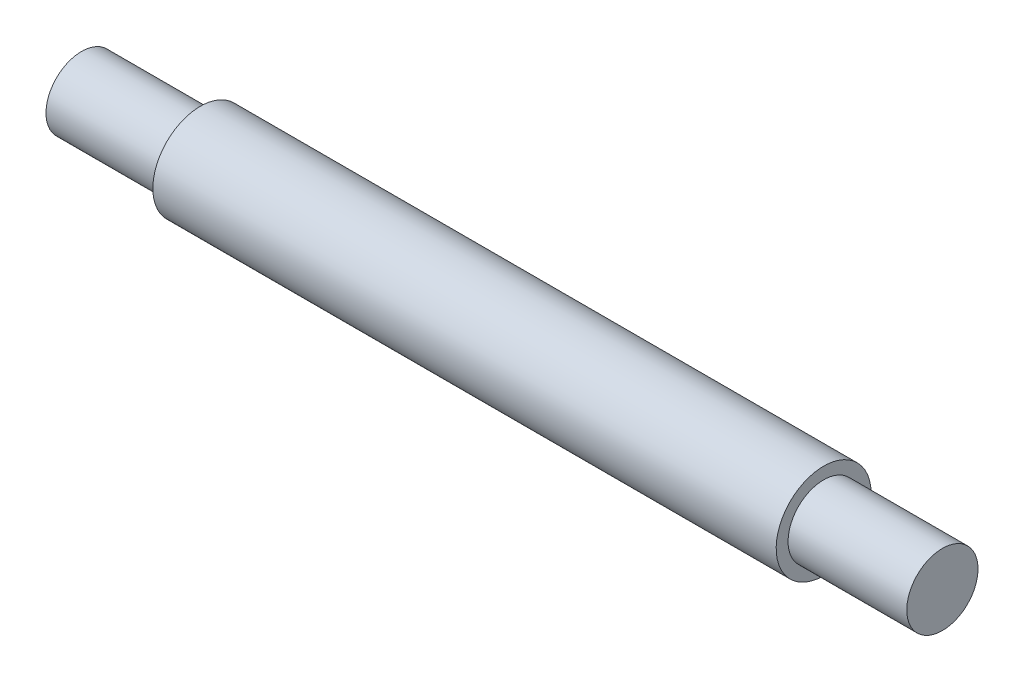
ISO-10303-21;
HEADER;
FILE_DESCRIPTION(('STEP AP214'),'2;1');
FILE_NAME('part.step','',(''),(''),'','','');
FILE_SCHEMA(('AUTOMOTIVE_DESIGN { 1 0 10303 214 1 1 1 1 }'));
ENDSEC;
DATA;
#1=APPLICATION_CONTEXT('core data for automotive mechanical design processes');
#2=APPLICATION_PROTOCOL_DEFINITION('international standard','automotive_design',2000,#1);
#3=PRODUCT_CONTEXT('',#1,'mechanical');
#4=PRODUCT('Part','Part','',(#3));
#5=PRODUCT_RELATED_PRODUCT_CATEGORY('part','',(#4));
#6=PRODUCT_DEFINITION_FORMATION('','',#4);
#7=PRODUCT_DEFINITION_CONTEXT('part definition',#1,'design');
#8=PRODUCT_DEFINITION('design','',#6,#7);
#9=PRODUCT_DEFINITION_SHAPE('','',#8);
#10=(LENGTH_UNIT() NAMED_UNIT(*) SI_UNIT(.MILLI.,.METRE.));
#11=(NAMED_UNIT(*) PLANE_ANGLE_UNIT() SI_UNIT($,.RADIAN.));
#12=(NAMED_UNIT(*) SI_UNIT($,.STERADIAN.) SOLID_ANGLE_UNIT());
#13=UNCERTAINTY_MEASURE_WITH_UNIT(LENGTH_MEASURE(1.E-05),#10,'distance_accuracy_value','');
#14=(GEOMETRIC_REPRESENTATION_CONTEXT(3) GLOBAL_UNCERTAINTY_ASSIGNED_CONTEXT((#13)) GLOBAL_UNIT_ASSIGNED_CONTEXT((#10,
#11,#12)) REPRESENTATION_CONTEXT('',''));
#15=CARTESIAN_POINT('',(0.,0.,0.));
#16=DIRECTION('',(0.,0.,1.));
#17=DIRECTION('',(1.,0.,0.));
#18=AXIS2_PLACEMENT_3D('',#15,#16,#17);
#19=CARTESIAN_POINT('',(36.25,0.,0.));
#20=DIRECTION('',(-1.,0.,0.));
#21=DIRECTION('',(0.,-1.,0.));
#22=AXIS2_PLACEMENT_3D('',#19,#20,#21);
#23=PLANE('',#22);
#24=CARTESIAN_POINT('',(36.25,0.,0.));
#25=DIRECTION('',(-1.,0.,0.));
#26=DIRECTION('',(0.,-1.,0.));
#27=AXIS2_PLACEMENT_3D('',#24,#25,#26);
#28=CIRCLE('',#27,3.);
#29=CARTESIAN_POINT('',(36.25,-3.00000000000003,0.));
#30=VERTEX_POINT('',#29);
#31=EDGE_CURVE('E10',#30,#30,#28,.T.);
#32=ORIENTED_EDGE('',*,*,#31,.F.);
#33=EDGE_LOOP('',(#32));
#34=FACE_BOUND('',#33,.T.);
#35=ADVANCED_FACE('F30',(#34),#23,.F.);
#36=CARTESIAN_POINT('',(-36.25,0.,0.));
#37=DIRECTION('',(-1.,0.,0.));
#38=DIRECTION('',(0.,-1.,0.));
#39=AXIS2_PLACEMENT_3D('',#36,#37,#38);
#40=CYLINDRICAL_SURFACE('',#39,3.);
#41=CARTESIAN_POINT('',(26.25,0.,0.));
#42=DIRECTION('',(-1.,0.,0.));
#43=DIRECTION('',(0.,-1.,0.));
#44=AXIS2_PLACEMENT_3D('',#41,#42,#43);
#45=CIRCLE('',#44,3.00000000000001);
#46=CARTESIAN_POINT('',(26.25,-3.00000000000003,0.));
#47=VERTEX_POINT('',#46);
#48=EDGE_CURVE('E36',#47,#47,#45,.T.);
#49=ORIENTED_EDGE('',*,*,#48,.F.);
#50=EDGE_LOOP('',(#49));
#51=FACE_BOUND('',#50,.T.);
#52=ORIENTED_EDGE('',*,*,#31,.T.);
#53=EDGE_LOOP('',(#52));
#54=FACE_BOUND('',#53,.T.);
#55=ADVANCED_FACE('F78',(#51,#54),#40,.T.);
#56=CARTESIAN_POINT('',(26.25,2.99999999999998,0.));
#57=DIRECTION('',(-1.,0.,0.));
#58=DIRECTION('',(0.,-1.,0.));
#59=AXIS2_PLACEMENT_3D('',#56,#57,#58);
#60=PLANE('',#59);
#61=CARTESIAN_POINT('',(26.25,0.,0.));
#62=DIRECTION('',(-1.,0.,0.));
#63=DIRECTION('',(0.,-1.,0.));
#64=AXIS2_PLACEMENT_3D('',#61,#62,#63);
#65=CIRCLE('',#64,4.00000000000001);
#66=CARTESIAN_POINT('',(26.25,-4.00000000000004,0.));
#67=VERTEX_POINT('',#66);
#68=EDGE_CURVE('E40',#67,#67,#65,.T.);
#69=ORIENTED_EDGE('',*,*,#68,.F.);
#70=EDGE_LOOP('',(#69));
#71=FACE_BOUND('',#70,.T.);
#72=ORIENTED_EDGE('',*,*,#48,.T.);
#73=EDGE_LOOP('',(#72));
#74=FACE_BOUND('',#73,.T.);
#75=ADVANCED_FACE('F73',(#71,#74),#60,.F.);
#76=CARTESIAN_POINT('',(-36.25,0.,0.));
#77=DIRECTION('',(-1.,0.,0.));
#78=DIRECTION('',(0.,-1.,0.));
#79=AXIS2_PLACEMENT_3D('',#76,#77,#78);
#80=CYLINDRICAL_SURFACE('',#79,4.00000000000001);
#81=CARTESIAN_POINT('',(-26.25,0.,0.));
#82=DIRECTION('',(-1.,0.,0.));
#83=DIRECTION('',(0.,-1.,0.));
#84=AXIS2_PLACEMENT_3D('',#81,#82,#83);
#85=CIRCLE('',#84,4.);
#86=CARTESIAN_POINT('',(-26.25,-4.00000000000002,0.));
#87=VERTEX_POINT('',#86);
#88=EDGE_CURVE('E44',#87,#87,#85,.T.);
#89=ORIENTED_EDGE('',*,*,#88,.F.);
#90=EDGE_LOOP('',(#89));
#91=FACE_BOUND('',#90,.T.);
#92=ORIENTED_EDGE('',*,*,#68,.T.);
#93=EDGE_LOOP('',(#92));
#94=FACE_BOUND('',#93,.T.);
#95=ADVANCED_FACE('F67',(#91,#94),#80,.T.);
#96=CARTESIAN_POINT('',(-26.25,2.99999999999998,0.));
#97=DIRECTION('',(1.,0.,0.));
#98=DIRECTION('',(0.,1.,0.));
#99=AXIS2_PLACEMENT_3D('',#96,#97,#98);
#100=PLANE('',#99);
#101=CARTESIAN_POINT('',(-26.25,0.,0.));
#102=DIRECTION('',(-1.,0.,0.));
#103=DIRECTION('',(0.,-1.,0.));
#104=AXIS2_PLACEMENT_3D('',#101,#102,#103);
#105=CIRCLE('',#104,3.);
#106=CARTESIAN_POINT('',(-26.25,-3.00000000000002,0.));
#107=VERTEX_POINT('',#106);
#108=EDGE_CURVE('E49',#107,#107,#105,.T.);
#109=ORIENTED_EDGE('',*,*,#108,.F.);
#110=EDGE_LOOP('',(#109));
#111=FACE_BOUND('',#110,.T.);
#112=ORIENTED_EDGE('',*,*,#88,.T.);
#113=EDGE_LOOP('',(#112));
#114=FACE_BOUND('',#113,.T.);
#115=ADVANCED_FACE('F61',(#111,#114),#100,.F.);
#116=CARTESIAN_POINT('',(-36.25,0.,0.));
#117=DIRECTION('',(-1.,0.,0.));
#118=DIRECTION('',(0.,-1.,0.));
#119=AXIS2_PLACEMENT_3D('',#116,#117,#118);
#120=CYLINDRICAL_SURFACE('',#119,2.99999999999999);
#121=CARTESIAN_POINT('',(-36.25,0.,0.));
#122=DIRECTION('',(-1.,0.,0.));
#123=DIRECTION('',(0.,-1.,0.));
#124=AXIS2_PLACEMENT_3D('',#121,#122,#123);
#125=CIRCLE('',#124,2.99999999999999);
#126=CARTESIAN_POINT('',(-36.25,-3.00000000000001,0.));
#127=VERTEX_POINT('',#126);
#128=EDGE_CURVE('E52',#127,#127,#125,.T.);
#129=ORIENTED_EDGE('',*,*,#128,.F.);
#130=EDGE_LOOP('',(#129));
#131=FACE_BOUND('',#130,.T.);
#132=ORIENTED_EDGE('',*,*,#108,.T.);
#133=EDGE_LOOP('',(#132));
#134=FACE_BOUND('',#133,.T.);
#135=ADVANCED_FACE('F58',(#131,#134),#120,.T.);
#136=CARTESIAN_POINT('',(-36.25,0.,0.));
#137=DIRECTION('',(1.,0.,0.));
#138=DIRECTION('',(0.,1.,0.));
#139=AXIS2_PLACEMENT_3D('',#136,#137,#138);
#140=PLANE('',#139);
#141=ORIENTED_EDGE('',*,*,#128,.T.);
#142=EDGE_LOOP('',(#141));
#143=FACE_BOUND('',#142,.T.);
#144=ADVANCED_FACE('F56',(#143),#140,.F.);
#145=CLOSED_SHELL('',(#35,#55,#75,#95,#115,#135,#144));
#146=MANIFOLD_SOLID_BREP('B2',#145);
#147=ADVANCED_BREP_SHAPE_REPRESENTATION('',(#18,#146),#14);
#148=SHAPE_DEFINITION_REPRESENTATION(#9,#147);
ENDSEC;
END-ISO-10303-21;
